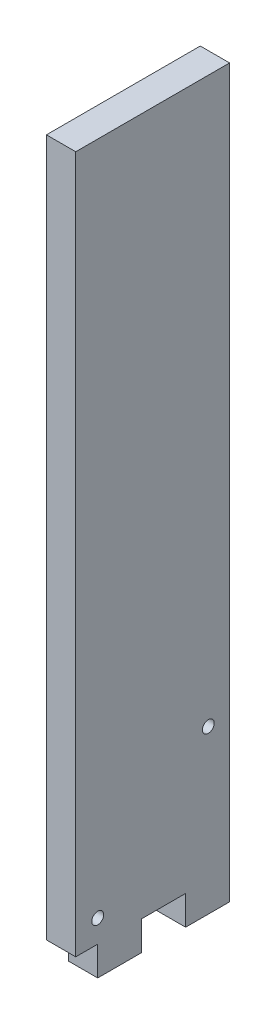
from build123d import *

# Parameters (mm, degrees)
SKETCH1_R           = 4.05
BOSS_EXTRUDE1_DEPTH = 20


with BuildPart() as part:
    # Sketch1 → Boss-Extrude1 (new body)
    with BuildSketch(Plane(origin=(0, 0, 0), x_dir=(0, 0, -1), z_dir=(1, 0, 0))):
        Polygon((0, 0), (15, 0), (15, -20), (45, -20), (45, 0), (75, 0), (75, -20), (105, -20), (105, 0), (105, 475.917508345), (0, 475.917508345), align=None)
        with Locations((15, 15.421190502)):
            Circle(SKETCH1_R, mode=Mode.SUBTRACT)
        with Locations((90.496317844, 90.917508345)):
            Circle(SKETCH1_R, mode=Mode.SUBTRACT)
    extrude(amount=BOSS_EXTRUDE1_DEPTH)


solid = part.part
